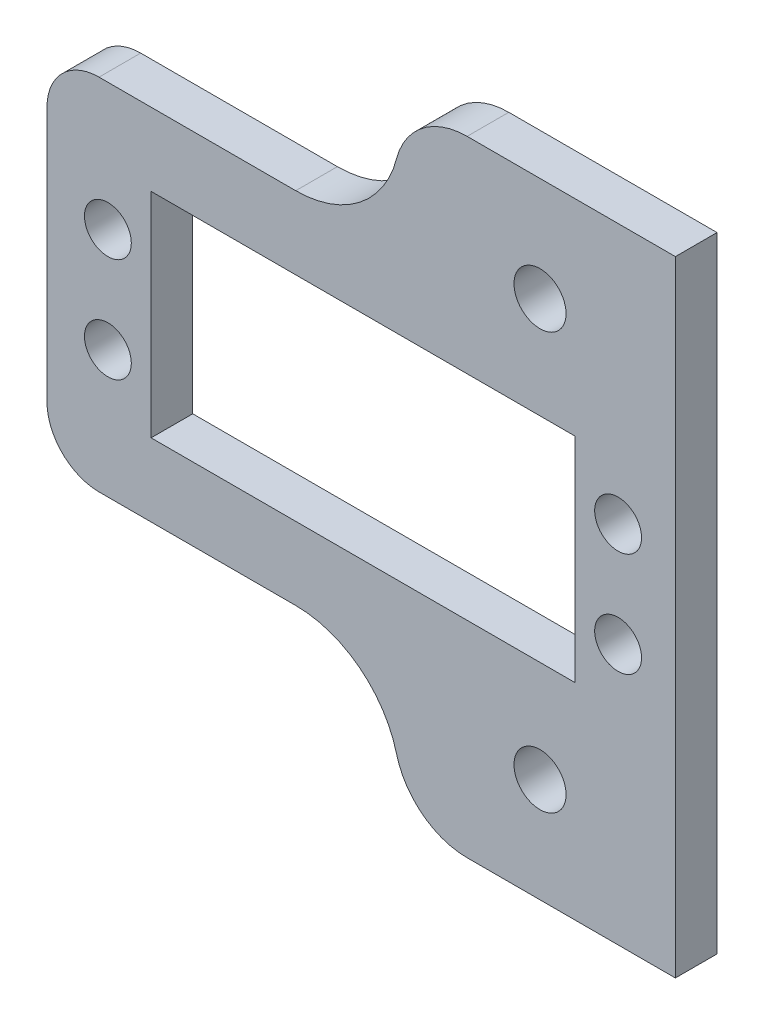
ISO-10303-21;
HEADER;
FILE_DESCRIPTION(('STEP AP214'),'2;1');
FILE_NAME('part.step','',(''),(''),'','','');
FILE_SCHEMA(('AUTOMOTIVE_DESIGN { 1 0 10303 214 1 1 1 1 }'));
ENDSEC;
DATA;
#1=APPLICATION_CONTEXT('core data for automotive mechanical design processes');
#2=APPLICATION_PROTOCOL_DEFINITION('international standard','automotive_design',2000,#1);
#3=PRODUCT_CONTEXT('',#1,'mechanical');
#4=PRODUCT('Part','Part','',(#3));
#5=PRODUCT_RELATED_PRODUCT_CATEGORY('part','',(#4));
#6=PRODUCT_DEFINITION_FORMATION('','',#4);
#7=PRODUCT_DEFINITION_CONTEXT('part definition',#1,'design');
#8=PRODUCT_DEFINITION('design','',#6,#7);
#9=PRODUCT_DEFINITION_SHAPE('','',#8);
#10=(LENGTH_UNIT() NAMED_UNIT(*) SI_UNIT(.MILLI.,.METRE.));
#11=(NAMED_UNIT(*) PLANE_ANGLE_UNIT() SI_UNIT($,.RADIAN.));
#12=(NAMED_UNIT(*) SI_UNIT($,.STERADIAN.) SOLID_ANGLE_UNIT());
#13=UNCERTAINTY_MEASURE_WITH_UNIT(LENGTH_MEASURE(1.E-05),#10,'distance_accuracy_value','');
#14=(GEOMETRIC_REPRESENTATION_CONTEXT(3) GLOBAL_UNCERTAINTY_ASSIGNED_CONTEXT((#13)) GLOBAL_UNIT_ASSIGNED_CONTEXT((#10,
#11,#12)) REPRESENTATION_CONTEXT('',''));
#15=CARTESIAN_POINT('',(0.,0.,0.));
#16=DIRECTION('',(0.,0.,1.));
#17=DIRECTION('',(1.,0.,0.));
#18=AXIS2_PLACEMENT_3D('',#15,#16,#17);
#19=CARTESIAN_POINT('',(9.99999999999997,23.,2.));
#20=DIRECTION('',(0.,0.,-1.));
#21=DIRECTION('',(-1.,0.,0.));
#22=AXIS2_PLACEMENT_3D('',#19,#20,#21);
#23=PLANE('',#22);
#24=CARTESIAN_POINT('',(-24.5,5.,2.));
#25=DIRECTION('',(0.,0.,1.));
#26=DIRECTION('',(1.,0.,0.));
#27=AXIS2_PLACEMENT_3D('',#24,#25,#26);
#28=CIRCLE('',#27,2.25);
#29=CARTESIAN_POINT('',(-22.25,5.,2.));
#30=VERTEX_POINT('',#29);
#31=EDGE_CURVE('E545',#30,#30,#28,.T.);
#32=ORIENTED_EDGE('',*,*,#31,.F.);
#33=EDGE_LOOP('',(#32));
#34=FACE_BOUND('',#33,.T.);
#35=CARTESIAN_POINT('',(-24.5,-5.,2.));
#36=DIRECTION('',(0.,0.,1.));
#37=DIRECTION('',(1.,0.,0.));
#38=AXIS2_PLACEMENT_3D('',#35,#36,#37);
#39=CIRCLE('',#38,2.25);
#40=CARTESIAN_POINT('',(-22.25,-5.,2.));
#41=VERTEX_POINT('',#40);
#42=EDGE_CURVE('E557',#41,#41,#39,.T.);
#43=ORIENTED_EDGE('',*,*,#42,.F.);
#44=EDGE_LOOP('',(#43));
#45=FACE_BOUND('',#44,.T.);
#46=CARTESIAN_POINT('',(17.,20.,2.));
#47=DIRECTION('',(0.,0.,1.));
#48=DIRECTION('',(1.,0.,0.));
#49=AXIS2_PLACEMENT_3D('',#46,#47,#48);
#50=CIRCLE('',#49,2.5);
#51=CARTESIAN_POINT('',(19.5,20.,2.));
#52=VERTEX_POINT('',#51);
#53=EDGE_CURVE('E174',#52,#52,#50,.T.);
#54=ORIENTED_EDGE('',*,*,#53,.F.);
#55=EDGE_LOOP('',(#54));
#56=FACE_BOUND('',#55,.T.);
#57=DIRECTION('',(1.,0.,0.));
#58=VECTOR('',#57,1.);
#59=CARTESIAN_POINT('',(10.,-30.,2.));
#60=LINE('',#59,#58);
#61=CARTESIAN_POINT('',(10.,-30.,2.));
#62=VERTEX_POINT('',#61);
#63=CARTESIAN_POINT('',(30.,-30.,2.));
#64=VERTEX_POINT('',#63);
#65=EDGE_CURVE('E184',#62,#64,#60,.T.);
#66=ORIENTED_EDGE('',*,*,#65,.T.);
#67=DIRECTION('',(0.,1.,0.));
#68=VECTOR('',#67,1.);
#69=CARTESIAN_POINT('',(30.,-30.,2.));
#70=LINE('',#69,#68);
#71=CARTESIAN_POINT('',(30.,30.,2.));
#72=VERTEX_POINT('',#71);
#73=EDGE_CURVE('E187',#64,#72,#70,.T.);
#74=ORIENTED_EDGE('',*,*,#73,.T.);
#75=DIRECTION('',(-1.,0.,0.));
#76=VECTOR('',#75,1.);
#77=CARTESIAN_POINT('',(9.99999999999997,30.,2.));
#78=LINE('',#77,#76);
#79=CARTESIAN_POINT('',(9.99999999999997,30.,2.));
#80=VERTEX_POINT('',#79);
#81=EDGE_CURVE('E190',#72,#80,#78,.T.);
#82=ORIENTED_EDGE('',*,*,#81,.T.);
#83=CARTESIAN_POINT('',(9.99999999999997,23.,2.));
#84=DIRECTION('',(0.,0.,1.));
#85=DIRECTION('',(-1.,0.,0.));
#86=AXIS2_PLACEMENT_3D('',#83,#84,#85);
#87=CIRCLE('',#86,6.99999999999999);
#88=CARTESIAN_POINT('',(3.22227914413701,24.75,2.));
#89=VERTEX_POINT('',#88);
#90=EDGE_CURVE('E192',#80,#89,#87,.T.);
#91=ORIENTED_EDGE('',*,*,#90,.T.);
#92=CARTESIAN_POINT('',(-6.46017922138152,27.25,2.));
#93=DIRECTION('',(0.,0.,-1.));
#94=DIRECTION('',(1.,0.,0.));
#95=AXIS2_PLACEMENT_3D('',#92,#93,#94);
#96=CIRCLE('',#95,10.);
#97=CARTESIAN_POINT('',(-6.46017922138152,17.25,2.));
#98=VERTEX_POINT('',#97);
#99=EDGE_CURVE('E194',#89,#98,#96,.T.);
#100=ORIENTED_EDGE('',*,*,#99,.T.);
#101=DIRECTION('',(-1.,0.,0.));
#102=VECTOR('',#101,1.);
#103=CARTESIAN_POINT('',(-25.35,17.25,2.));
#104=LINE('',#103,#102);
#105=CARTESIAN_POINT('',(-25.35,17.25,2.));
#106=VERTEX_POINT('',#105);
#107=EDGE_CURVE('E196',#98,#106,#104,.T.);
#108=ORIENTED_EDGE('',*,*,#107,.T.);
#109=CARTESIAN_POINT('',(-25.35,12.25,2.));
#110=DIRECTION('',(0.,0.,1.));
#111=DIRECTION('',(-1.,0.,0.));
#112=AXIS2_PLACEMENT_3D('',#109,#110,#111);
#113=CIRCLE('',#112,5.);
#114=CARTESIAN_POINT('',(-30.35,12.25,2.));
#115=VERTEX_POINT('',#114);
#116=EDGE_CURVE('E198',#106,#115,#113,.T.);
#117=ORIENTED_EDGE('',*,*,#116,.T.);
#118=DIRECTION('',(0.,-1.,0.));
#119=VECTOR('',#118,1.);
#120=CARTESIAN_POINT('',(-30.35,-12.25,2.));
#121=LINE('',#120,#119);
#122=CARTESIAN_POINT('',(-30.35,-12.25,2.));
#123=VERTEX_POINT('',#122);
#124=EDGE_CURVE('E200',#115,#123,#121,.T.);
#125=ORIENTED_EDGE('',*,*,#124,.T.);
#126=CARTESIAN_POINT('',(-25.35,-12.25,2.));
#127=DIRECTION('',(0.,0.,1.));
#128=DIRECTION('',(1.,0.,0.));
#129=AXIS2_PLACEMENT_3D('',#126,#127,#128);
#130=CIRCLE('',#129,5.);
#131=CARTESIAN_POINT('',(-25.35,-17.25,2.));
#132=VERTEX_POINT('',#131);
#133=EDGE_CURVE('E202',#123,#132,#130,.T.);
#134=ORIENTED_EDGE('',*,*,#133,.T.);
#135=DIRECTION('',(1.,0.,0.));
#136=VECTOR('',#135,1.);
#137=CARTESIAN_POINT('',(-25.35,-17.25,2.));
#138=LINE('',#137,#136);
#139=CARTESIAN_POINT('',(-6.46017922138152,-17.25,2.));
#140=VERTEX_POINT('',#139);
#141=EDGE_CURVE('E204',#132,#140,#138,.T.);
#142=ORIENTED_EDGE('',*,*,#141,.T.);
#143=CARTESIAN_POINT('',(-6.46017922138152,-27.25,2.));
#144=DIRECTION('',(0.,0.,-1.));
#145=DIRECTION('',(-1.,0.,0.));
#146=AXIS2_PLACEMENT_3D('',#143,#144,#145);
#147=CIRCLE('',#146,10.);
#148=CARTESIAN_POINT('',(3.22227914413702,-24.75,2.));
#149=VERTEX_POINT('',#148);
#150=EDGE_CURVE('E206',#140,#149,#147,.T.);
#151=ORIENTED_EDGE('',*,*,#150,.T.);
#152=CARTESIAN_POINT('',(10.,-23.,2.));
#153=DIRECTION('',(0.,0.,1.));
#154=DIRECTION('',(1.,0.,0.));
#155=AXIS2_PLACEMENT_3D('',#152,#153,#154);
#156=CIRCLE('',#155,7.);
#157=EDGE_CURVE('E208',#149,#62,#156,.T.);
#158=ORIENTED_EDGE('',*,*,#157,.T.);
#159=EDGE_LOOP('',(#66,#74,#82,#91,#100,#108,#117,#125,#134,#142,#151,#158));
#160=FACE_BOUND('',#159,.T.);
#161=DIRECTION('',(0.,-1.,0.));
#162=VECTOR('',#161,1.);
#163=CARTESIAN_POINT('',(-20.35,10.25,2.));
#164=LINE('',#163,#162);
#165=CARTESIAN_POINT('',(-20.35,10.25,2.));
#166=VERTEX_POINT('',#165);
#167=CARTESIAN_POINT('',(-20.35,-10.25,2.));
#168=VERTEX_POINT('',#167);
#169=EDGE_CURVE('E145',#166,#168,#164,.T.);
#170=ORIENTED_EDGE('',*,*,#169,.F.);
#171=DIRECTION('',(-1.,0.,0.));
#172=VECTOR('',#171,1.);
#173=CARTESIAN_POINT('',(20.35,10.25,2.));
#174=LINE('',#173,#172);
#175=CARTESIAN_POINT('',(20.35,10.25,2.));
#176=VERTEX_POINT('',#175);
#177=EDGE_CURVE('E168',#176,#166,#174,.T.);
#178=ORIENTED_EDGE('',*,*,#177,.F.);
#179=DIRECTION('',(0.,1.,0.));
#180=VECTOR('',#179,1.);
#181=CARTESIAN_POINT('',(20.35,10.25,2.));
#182=LINE('',#181,#180);
#183=CARTESIAN_POINT('',(20.35,-10.25,2.));
#184=VERTEX_POINT('',#183);
#185=EDGE_CURVE('E166',#184,#176,#182,.T.);
#186=ORIENTED_EDGE('',*,*,#185,.F.);
#187=DIRECTION('',(1.,0.,0.));
#188=VECTOR('',#187,1.);
#189=CARTESIAN_POINT('',(20.35,-10.25,2.));
#190=LINE('',#189,#188);
#191=EDGE_CURVE('E153',#168,#184,#190,.T.);
#192=ORIENTED_EDGE('',*,*,#191,.F.);
#193=EDGE_LOOP('',(#170,#178,#186,#192));
#194=FACE_BOUND('',#193,.T.);
#195=CARTESIAN_POINT('',(17.,-20.,2.));
#196=DIRECTION('',(0.,0.,1.));
#197=DIRECTION('',(1.,0.,0.));
#198=AXIS2_PLACEMENT_3D('',#195,#196,#197);
#199=CIRCLE('',#198,2.50000000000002);
#200=CARTESIAN_POINT('',(19.5,-20.,2.));
#201=VERTEX_POINT('',#200);
#202=EDGE_CURVE('E563',#201,#201,#199,.T.);
#203=ORIENTED_EDGE('',*,*,#202,.F.);
#204=EDGE_LOOP('',(#203));
#205=FACE_BOUND('',#204,.T.);
#206=CARTESIAN_POINT('',(24.5,-5.,2.));
#207=DIRECTION('',(0.,0.,1.));
#208=DIRECTION('',(1.,0.,0.));
#209=AXIS2_PLACEMENT_3D('',#206,#207,#208);
#210=CIRCLE('',#209,2.24999999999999);
#211=CARTESIAN_POINT('',(26.75,-5.,2.));
#212=VERTEX_POINT('',#211);
#213=EDGE_CURVE('E551',#212,#212,#210,.T.);
#214=ORIENTED_EDGE('',*,*,#213,.F.);
#215=EDGE_LOOP('',(#214));
#216=FACE_BOUND('',#215,.T.);
#217=CARTESIAN_POINT('',(24.5,5.,2.));
#218=DIRECTION('',(0.,0.,1.));
#219=DIRECTION('',(1.,0.,0.));
#220=AXIS2_PLACEMENT_3D('',#217,#218,#219);
#221=CIRCLE('',#220,2.25);
#222=CARTESIAN_POINT('',(26.75,5.,2.));
#223=VERTEX_POINT('',#222);
#224=EDGE_CURVE('E536',#223,#223,#221,.T.);
#225=ORIENTED_EDGE('',*,*,#224,.F.);
#226=EDGE_LOOP('',(#225));
#227=FACE_BOUND('',#226,.T.);
#228=ADVANCED_FACE('F32',(#34,#45,#56,#160,#194,#205,#216,#227),#23,.F.);
#229=CARTESIAN_POINT('',(9.99999999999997,23.,-2.));
#230=DIRECTION('',(0.,0.,-1.));
#231=DIRECTION('',(-1.,0.,0.));
#232=AXIS2_PLACEMENT_3D('',#229,#230,#231);
#233=PLANE('',#232);
#234=CARTESIAN_POINT('',(-24.5,5.,-2.));
#235=DIRECTION('',(0.,0.,1.));
#236=DIRECTION('',(1.,0.,0.));
#237=AXIS2_PLACEMENT_3D('',#234,#235,#236);
#238=CIRCLE('',#237,2.25);
#239=CARTESIAN_POINT('',(-22.25,5.,-2.));
#240=VERTEX_POINT('',#239);
#241=EDGE_CURVE('E542',#240,#240,#238,.T.);
#242=ORIENTED_EDGE('',*,*,#241,.T.);
#243=EDGE_LOOP('',(#242));
#244=FACE_BOUND('',#243,.T.);
#245=CARTESIAN_POINT('',(-24.5,-5.,-2.));
#246=DIRECTION('',(0.,0.,1.));
#247=DIRECTION('',(1.,0.,0.));
#248=AXIS2_PLACEMENT_3D('',#245,#246,#247);
#249=CIRCLE('',#248,2.25);
#250=CARTESIAN_POINT('',(-22.25,-5.,-2.));
#251=VERTEX_POINT('',#250);
#252=EDGE_CURVE('E554',#251,#251,#249,.T.);
#253=ORIENTED_EDGE('',*,*,#252,.T.);
#254=EDGE_LOOP('',(#253));
#255=FACE_BOUND('',#254,.T.);
#256=CARTESIAN_POINT('',(17.,20.,-2.));
#257=DIRECTION('',(0.,0.,1.));
#258=DIRECTION('',(1.,0.,0.));
#259=AXIS2_PLACEMENT_3D('',#256,#257,#258);
#260=CIRCLE('',#259,2.5);
#261=CARTESIAN_POINT('',(19.5,20.,-2.));
#262=VERTEX_POINT('',#261);
#263=EDGE_CURVE('E566',#262,#262,#260,.T.);
#264=ORIENTED_EDGE('',*,*,#263,.T.);
#265=EDGE_LOOP('',(#264));
#266=FACE_BOUND('',#265,.T.);
#267=DIRECTION('',(1.,0.,0.));
#268=VECTOR('',#267,1.);
#269=CARTESIAN_POINT('',(10.,-30.,-2.));
#270=LINE('',#269,#268);
#271=CARTESIAN_POINT('',(10.,-30.,-2.));
#272=VERTEX_POINT('',#271);
#273=CARTESIAN_POINT('',(30.,-30.,-2.));
#274=VERTEX_POINT('',#273);
#275=EDGE_CURVE('E161',#272,#274,#270,.T.);
#276=ORIENTED_EDGE('',*,*,#275,.F.);
#277=CARTESIAN_POINT('',(10.,-23.,-2.));
#278=DIRECTION('',(0.,0.,1.));
#279=DIRECTION('',(1.,0.,0.));
#280=AXIS2_PLACEMENT_3D('',#277,#278,#279);
#281=CIRCLE('',#280,7.);
#282=CARTESIAN_POINT('',(3.22227914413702,-24.75,-2.));
#283=VERTEX_POINT('',#282);
#284=EDGE_CURVE('E188',#283,#272,#281,.T.);
#285=ORIENTED_EDGE('',*,*,#284,.F.);
#286=CARTESIAN_POINT('',(-6.46017922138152,-27.25,-2.));
#287=DIRECTION('',(0.,0.,-1.));
#288=DIRECTION('',(-1.,0.,0.));
#289=AXIS2_PLACEMENT_3D('',#286,#287,#288);
#290=CIRCLE('',#289,10.);
#291=CARTESIAN_POINT('',(-6.46017922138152,-17.25,-2.));
#292=VERTEX_POINT('',#291);
#293=EDGE_CURVE('E231',#292,#283,#290,.T.);
#294=ORIENTED_EDGE('',*,*,#293,.F.);
#295=DIRECTION('',(1.,0.,0.));
#296=VECTOR('',#295,1.);
#297=CARTESIAN_POINT('',(-25.35,-17.25,-2.));
#298=LINE('',#297,#296);
#299=CARTESIAN_POINT('',(-25.35,-17.25,-2.));
#300=VERTEX_POINT('',#299);
#301=EDGE_CURVE('E229',#300,#292,#298,.T.);
#302=ORIENTED_EDGE('',*,*,#301,.F.);
#303=CARTESIAN_POINT('',(-25.35,-12.25,-2.));
#304=DIRECTION('',(0.,0.,1.));
#305=DIRECTION('',(1.,0.,0.));
#306=AXIS2_PLACEMENT_3D('',#303,#304,#305);
#307=CIRCLE('',#306,5.);
#308=CARTESIAN_POINT('',(-30.35,-12.25,-2.));
#309=VERTEX_POINT('',#308);
#310=EDGE_CURVE('E227',#309,#300,#307,.T.);
#311=ORIENTED_EDGE('',*,*,#310,.F.);
#312=DIRECTION('',(0.,-1.,0.));
#313=VECTOR('',#312,1.);
#314=CARTESIAN_POINT('',(-30.35,-12.25,-2.));
#315=LINE('',#314,#313);
#316=CARTESIAN_POINT('',(-30.35,12.25,-2.));
#317=VERTEX_POINT('',#316);
#318=EDGE_CURVE('E225',#317,#309,#315,.T.);
#319=ORIENTED_EDGE('',*,*,#318,.F.);
#320=CARTESIAN_POINT('',(-25.35,12.25,-2.));
#321=DIRECTION('',(0.,0.,1.));
#322=DIRECTION('',(-1.,0.,0.));
#323=AXIS2_PLACEMENT_3D('',#320,#321,#322);
#324=CIRCLE('',#323,5.);
#325=CARTESIAN_POINT('',(-25.35,17.25,-2.));
#326=VERTEX_POINT('',#325);
#327=EDGE_CURVE('E223',#326,#317,#324,.T.);
#328=ORIENTED_EDGE('',*,*,#327,.F.);
#329=DIRECTION('',(-1.,0.,0.));
#330=VECTOR('',#329,1.);
#331=CARTESIAN_POINT('',(-25.35,17.25,-2.));
#332=LINE('',#331,#330);
#333=CARTESIAN_POINT('',(-6.46017922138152,17.25,-2.));
#334=VERTEX_POINT('',#333);
#335=EDGE_CURVE('E221',#334,#326,#332,.T.);
#336=ORIENTED_EDGE('',*,*,#335,.F.);
#337=CARTESIAN_POINT('',(-6.46017922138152,27.25,-2.));
#338=DIRECTION('',(0.,0.,-1.));
#339=DIRECTION('',(1.,0.,0.));
#340=AXIS2_PLACEMENT_3D('',#337,#338,#339);
#341=CIRCLE('',#340,10.);
#342=CARTESIAN_POINT('',(3.22227914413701,24.75,-2.));
#343=VERTEX_POINT('',#342);
#344=EDGE_CURVE('E219',#343,#334,#341,.T.);
#345=ORIENTED_EDGE('',*,*,#344,.F.);
#346=CARTESIAN_POINT('',(9.99999999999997,23.,-2.));
#347=DIRECTION('',(0.,0.,1.));
#348=DIRECTION('',(-1.,0.,0.));
#349=AXIS2_PLACEMENT_3D('',#346,#347,#348);
#350=CIRCLE('',#349,6.99999999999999);
#351=CARTESIAN_POINT('',(9.99999999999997,30.,-2.));
#352=VERTEX_POINT('',#351);
#353=EDGE_CURVE('E217',#352,#343,#350,.T.);
#354=ORIENTED_EDGE('',*,*,#353,.F.);
#355=DIRECTION('',(-1.,0.,0.));
#356=VECTOR('',#355,1.);
#357=CARTESIAN_POINT('',(9.99999999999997,30.,-2.));
#358=LINE('',#357,#356);
#359=CARTESIAN_POINT('',(30.,30.,-2.));
#360=VERTEX_POINT('',#359);
#361=EDGE_CURVE('E215',#360,#352,#358,.T.);
#362=ORIENTED_EDGE('',*,*,#361,.F.);
#363=DIRECTION('',(0.,1.,0.));
#364=VECTOR('',#363,1.);
#365=CARTESIAN_POINT('',(30.,-30.,-2.));
#366=LINE('',#365,#364);
#367=EDGE_CURVE('E213',#274,#360,#366,.T.);
#368=ORIENTED_EDGE('',*,*,#367,.F.);
#369=EDGE_LOOP('',(#276,#285,#294,#302,#311,#319,#328,#336,#345,#354,#362,#368));
#370=FACE_BOUND('',#369,.T.);
#371=DIRECTION('',(-1.,0.,0.));
#372=VECTOR('',#371,1.);
#373=CARTESIAN_POINT('',(20.35,10.25,-2.));
#374=LINE('',#373,#372);
#375=CARTESIAN_POINT('',(20.35,10.25,-2.));
#376=VERTEX_POINT('',#375);
#377=CARTESIAN_POINT('',(-20.35,10.25,-2.));
#378=VERTEX_POINT('',#377);
#379=EDGE_CURVE('E154',#376,#378,#374,.T.);
#380=ORIENTED_EDGE('',*,*,#379,.T.);
#381=DIRECTION('',(0.,-1.,0.));
#382=VECTOR('',#381,1.);
#383=CARTESIAN_POINT('',(-20.35,10.25,-2.));
#384=LINE('',#383,#382);
#385=CARTESIAN_POINT('',(-20.35,-10.25,-2.));
#386=VERTEX_POINT('',#385);
#387=EDGE_CURVE('E55',#378,#386,#384,.T.);
#388=ORIENTED_EDGE('',*,*,#387,.T.);
#389=DIRECTION('',(1.,0.,0.));
#390=VECTOR('',#389,1.);
#391=CARTESIAN_POINT('',(20.35,-10.25,-2.));
#392=LINE('',#391,#390);
#393=CARTESIAN_POINT('',(20.35,-10.25,-2.));
#394=VERTEX_POINT('',#393);
#395=EDGE_CURVE('E160',#386,#394,#392,.T.);
#396=ORIENTED_EDGE('',*,*,#395,.T.);
#397=DIRECTION('',(0.,1.,0.));
#398=VECTOR('',#397,1.);
#399=CARTESIAN_POINT('',(20.35,10.25,-2.));
#400=LINE('',#399,#398);
#401=EDGE_CURVE('E176',#394,#376,#400,.T.);
#402=ORIENTED_EDGE('',*,*,#401,.T.);
#403=EDGE_LOOP('',(#380,#388,#396,#402));
#404=FACE_BOUND('',#403,.T.);
#405=CARTESIAN_POINT('',(17.,-20.,-2.));
#406=DIRECTION('',(0.,0.,1.));
#407=DIRECTION('',(1.,0.,0.));
#408=AXIS2_PLACEMENT_3D('',#405,#406,#407);
#409=CIRCLE('',#408,2.50000000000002);
#410=CARTESIAN_POINT('',(19.5,-20.,-2.));
#411=VERTEX_POINT('',#410);
#412=EDGE_CURVE('E560',#411,#411,#409,.T.);
#413=ORIENTED_EDGE('',*,*,#412,.T.);
#414=EDGE_LOOP('',(#413));
#415=FACE_BOUND('',#414,.T.);
#416=CARTESIAN_POINT('',(24.5,-5.,-2.));
#417=DIRECTION('',(0.,0.,1.));
#418=DIRECTION('',(1.,0.,0.));
#419=AXIS2_PLACEMENT_3D('',#416,#417,#418);
#420=CIRCLE('',#419,2.24999999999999);
#421=CARTESIAN_POINT('',(26.75,-5.,-2.));
#422=VERTEX_POINT('',#421);
#423=EDGE_CURVE('E548',#422,#422,#420,.T.);
#424=ORIENTED_EDGE('',*,*,#423,.T.);
#425=EDGE_LOOP('',(#424));
#426=FACE_BOUND('',#425,.T.);
#427=CARTESIAN_POINT('',(24.5,5.,-2.));
#428=DIRECTION('',(0.,0.,1.));
#429=DIRECTION('',(1.,0.,0.));
#430=AXIS2_PLACEMENT_3D('',#427,#428,#429);
#431=CIRCLE('',#430,2.25);
#432=CARTESIAN_POINT('',(26.75,5.,-2.));
#433=VERTEX_POINT('',#432);
#434=EDGE_CURVE('E539',#433,#433,#431,.T.);
#435=ORIENTED_EDGE('',*,*,#434,.T.);
#436=EDGE_LOOP('',(#435));
#437=FACE_BOUND('',#436,.T.);
#438=ADVANCED_FACE('F273',(#244,#255,#266,#370,#404,#415,#426,#437),#233,.T.);
#439=CARTESIAN_POINT('',(10.,-30.,2.));
#440=DIRECTION('',(0.,1.,0.));
#441=DIRECTION('',(0.,0.,1.));
#442=AXIS2_PLACEMENT_3D('',#439,#440,#441);
#443=PLANE('',#442);
#444=ORIENTED_EDGE('',*,*,#275,.T.);
#445=DIRECTION('',(0.,0.,-1.));
#446=VECTOR('',#445,1.);
#447=CARTESIAN_POINT('',(30.,-30.,2.));
#448=LINE('',#447,#446);
#449=EDGE_CURVE('E11',#64,#274,#448,.T.);
#450=ORIENTED_EDGE('',*,*,#449,.F.);
#451=ORIENTED_EDGE('',*,*,#65,.F.);
#452=DIRECTION('',(0.,0.,-1.));
#453=VECTOR('',#452,1.);
#454=CARTESIAN_POINT('',(10.,-30.,2.));
#455=LINE('',#454,#453);
#456=EDGE_CURVE('E210',#62,#272,#455,.T.);
#457=ORIENTED_EDGE('',*,*,#456,.T.);
#458=EDGE_LOOP('',(#444,#450,#451,#457));
#459=FACE_BOUND('',#458,.T.);
#460=ADVANCED_FACE('F34',(#459),#443,.F.);
#461=CARTESIAN_POINT('',(30.,-30.,2.));
#462=DIRECTION('',(-1.,0.,0.));
#463=DIRECTION('',(0.,0.,1.));
#464=AXIS2_PLACEMENT_3D('',#461,#462,#463);
#465=PLANE('',#464);
#466=ORIENTED_EDGE('',*,*,#367,.T.);
#467=DIRECTION('',(0.,0.,-1.));
#468=VECTOR('',#467,1.);
#469=CARTESIAN_POINT('',(30.,30.,2.));
#470=LINE('',#469,#468);
#471=EDGE_CURVE('E40',#72,#360,#470,.T.);
#472=ORIENTED_EDGE('',*,*,#471,.F.);
#473=ORIENTED_EDGE('',*,*,#73,.F.);
#474=ORIENTED_EDGE('',*,*,#449,.T.);
#475=EDGE_LOOP('',(#466,#472,#473,#474));
#476=FACE_BOUND('',#475,.T.);
#477=ADVANCED_FACE('F290',(#476),#465,.F.);
#478=CARTESIAN_POINT('',(9.99999999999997,30.,2.));
#479=DIRECTION('',(0.,-1.,0.));
#480=DIRECTION('',(0.,0.,-1.));
#481=AXIS2_PLACEMENT_3D('',#478,#479,#480);
#482=PLANE('',#481);
#483=ORIENTED_EDGE('',*,*,#361,.T.);
#484=DIRECTION('',(0.,0.,-1.));
#485=VECTOR('',#484,1.);
#486=CARTESIAN_POINT('',(9.99999999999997,30.,2.));
#487=LINE('',#486,#485);
#488=EDGE_CURVE('E260',#80,#352,#487,.T.);
#489=ORIENTED_EDGE('',*,*,#488,.F.);
#490=ORIENTED_EDGE('',*,*,#81,.F.);
#491=ORIENTED_EDGE('',*,*,#471,.T.);
#492=EDGE_LOOP('',(#483,#489,#490,#491));
#493=FACE_BOUND('',#492,.T.);
#494=ADVANCED_FACE('F267',(#493),#482,.F.);
#495=CARTESIAN_POINT('',(9.99999999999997,23.,2.));
#496=DIRECTION('',(0.,0.,-1.));
#497=DIRECTION('',(-1.,0.,0.));
#498=AXIS2_PLACEMENT_3D('',#495,#496,#497);
#499=CYLINDRICAL_SURFACE('',#498,6.99999999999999);
#500=ORIENTED_EDGE('',*,*,#353,.T.);
#501=DIRECTION('',(0.,0.,-1.));
#502=VECTOR('',#501,1.);
#503=CARTESIAN_POINT('',(3.22227914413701,24.75,2.));
#504=LINE('',#503,#502);
#505=EDGE_CURVE('E257',#89,#343,#504,.T.);
#506=ORIENTED_EDGE('',*,*,#505,.F.);
#507=ORIENTED_EDGE('',*,*,#90,.F.);
#508=ORIENTED_EDGE('',*,*,#488,.T.);
#509=EDGE_LOOP('',(#500,#506,#507,#508));
#510=FACE_BOUND('',#509,.T.);
#511=ADVANCED_FACE('F279',(#510),#499,.T.);
#512=CARTESIAN_POINT('',(-6.46017922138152,27.25,2.));
#513=DIRECTION('',(0.,0.,-1.));
#514=DIRECTION('',(-1.,0.,0.));
#515=AXIS2_PLACEMENT_3D('',#512,#513,#514);
#516=CYLINDRICAL_SURFACE('',#515,10.);
#517=ORIENTED_EDGE('',*,*,#344,.T.);
#518=DIRECTION('',(0.,0.,-1.));
#519=VECTOR('',#518,1.);
#520=CARTESIAN_POINT('',(-6.46017922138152,17.25,2.));
#521=LINE('',#520,#519);
#522=EDGE_CURVE('E254',#98,#334,#521,.T.);
#523=ORIENTED_EDGE('',*,*,#522,.F.);
#524=ORIENTED_EDGE('',*,*,#99,.F.);
#525=ORIENTED_EDGE('',*,*,#505,.T.);
#526=EDGE_LOOP('',(#517,#523,#524,#525));
#527=FACE_BOUND('',#526,.T.);
#528=ADVANCED_FACE('F283',(#527),#516,.F.);
#529=CARTESIAN_POINT('',(-25.35,17.25,2.));
#530=DIRECTION('',(0.,-1.,0.));
#531=DIRECTION('',(0.,0.,-1.));
#532=AXIS2_PLACEMENT_3D('',#529,#530,#531);
#533=PLANE('',#532);
#534=ORIENTED_EDGE('',*,*,#335,.T.);
#535=DIRECTION('',(0.,0.,-1.));
#536=VECTOR('',#535,1.);
#537=CARTESIAN_POINT('',(-25.35,17.25,2.));
#538=LINE('',#537,#536);
#539=EDGE_CURVE('E251',#106,#326,#538,.T.);
#540=ORIENTED_EDGE('',*,*,#539,.F.);
#541=ORIENTED_EDGE('',*,*,#107,.F.);
#542=ORIENTED_EDGE('',*,*,#522,.T.);
#543=EDGE_LOOP('',(#534,#540,#541,#542));
#544=FACE_BOUND('',#543,.T.);
#545=ADVANCED_FACE('F323',(#544),#533,.F.);
#546=CARTESIAN_POINT('',(-25.35,12.25,2.));
#547=DIRECTION('',(0.,0.,-1.));
#548=DIRECTION('',(-1.,0.,0.));
#549=AXIS2_PLACEMENT_3D('',#546,#547,#548);
#550=CYLINDRICAL_SURFACE('',#549,5.);
#551=ORIENTED_EDGE('',*,*,#327,.T.);
#552=DIRECTION('',(0.,0.,-1.));
#553=VECTOR('',#552,1.);
#554=CARTESIAN_POINT('',(-30.35,12.25,2.));
#555=LINE('',#554,#553);
#556=EDGE_CURVE('E248',#115,#317,#555,.T.);
#557=ORIENTED_EDGE('',*,*,#556,.F.);
#558=ORIENTED_EDGE('',*,*,#116,.F.);
#559=ORIENTED_EDGE('',*,*,#539,.T.);
#560=EDGE_LOOP('',(#551,#557,#558,#559));
#561=FACE_BOUND('',#560,.T.);
#562=ADVANCED_FACE('F321',(#561),#550,.T.);
#563=CARTESIAN_POINT('',(-30.35,-12.25,2.));
#564=DIRECTION('',(1.,0.,0.));
#565=DIRECTION('',(0.,0.,-1.));
#566=AXIS2_PLACEMENT_3D('',#563,#564,#565);
#567=PLANE('',#566);
#568=ORIENTED_EDGE('',*,*,#318,.T.);
#569=DIRECTION('',(0.,0.,-1.));
#570=VECTOR('',#569,1.);
#571=CARTESIAN_POINT('',(-30.35,-12.25,2.));
#572=LINE('',#571,#570);
#573=EDGE_CURVE('E245',#123,#309,#572,.T.);
#574=ORIENTED_EDGE('',*,*,#573,.F.);
#575=ORIENTED_EDGE('',*,*,#124,.F.);
#576=ORIENTED_EDGE('',*,*,#556,.T.);
#577=EDGE_LOOP('',(#568,#574,#575,#576));
#578=FACE_BOUND('',#577,.T.);
#579=ADVANCED_FACE('F317',(#578),#567,.F.);
#580=CARTESIAN_POINT('',(-25.35,-12.25,2.));
#581=DIRECTION('',(0.,0.,-1.));
#582=DIRECTION('',(-1.,0.,0.));
#583=AXIS2_PLACEMENT_3D('',#580,#581,#582);
#584=CYLINDRICAL_SURFACE('',#583,5.);
#585=ORIENTED_EDGE('',*,*,#310,.T.);
#586=DIRECTION('',(0.,0.,-1.));
#587=VECTOR('',#586,1.);
#588=CARTESIAN_POINT('',(-25.35,-17.25,2.));
#589=LINE('',#588,#587);
#590=EDGE_CURVE('E242',#132,#300,#589,.T.);
#591=ORIENTED_EDGE('',*,*,#590,.F.);
#592=ORIENTED_EDGE('',*,*,#133,.F.);
#593=ORIENTED_EDGE('',*,*,#573,.T.);
#594=EDGE_LOOP('',(#585,#591,#592,#593));
#595=FACE_BOUND('',#594,.T.);
#596=ADVANCED_FACE('F312',(#595),#584,.T.);
#597=CARTESIAN_POINT('',(-25.35,-17.25,2.));
#598=DIRECTION('',(0.,1.,0.));
#599=DIRECTION('',(0.,0.,1.));
#600=AXIS2_PLACEMENT_3D('',#597,#598,#599);
#601=PLANE('',#600);
#602=ORIENTED_EDGE('',*,*,#301,.T.);
#603=DIRECTION('',(0.,0.,-1.));
#604=VECTOR('',#603,1.);
#605=CARTESIAN_POINT('',(-6.46017922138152,-17.25,2.));
#606=LINE('',#605,#604);
#607=EDGE_CURVE('E239',#140,#292,#606,.T.);
#608=ORIENTED_EDGE('',*,*,#607,.F.);
#609=ORIENTED_EDGE('',*,*,#141,.F.);
#610=ORIENTED_EDGE('',*,*,#590,.T.);
#611=EDGE_LOOP('',(#602,#608,#609,#610));
#612=FACE_BOUND('',#611,.T.);
#613=ADVANCED_FACE('F306',(#612),#601,.F.);
#614=CARTESIAN_POINT('',(-6.46017922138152,-27.25,2.));
#615=DIRECTION('',(0.,0.,-1.));
#616=DIRECTION('',(-1.,0.,0.));
#617=AXIS2_PLACEMENT_3D('',#614,#615,#616);
#618=CYLINDRICAL_SURFACE('',#617,10.);
#619=ORIENTED_EDGE('',*,*,#293,.T.);
#620=DIRECTION('',(0.,0.,-1.));
#621=VECTOR('',#620,1.);
#622=CARTESIAN_POINT('',(3.22227914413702,-24.75,2.));
#623=LINE('',#622,#621);
#624=EDGE_CURVE('E236',#149,#283,#623,.T.);
#625=ORIENTED_EDGE('',*,*,#624,.F.);
#626=ORIENTED_EDGE('',*,*,#150,.F.);
#627=ORIENTED_EDGE('',*,*,#607,.T.);
#628=EDGE_LOOP('',(#619,#625,#626,#627));
#629=FACE_BOUND('',#628,.T.);
#630=ADVANCED_FACE('F302',(#629),#618,.F.);
#631=CARTESIAN_POINT('',(10.,-23.,2.));
#632=DIRECTION('',(0.,0.,-1.));
#633=DIRECTION('',(-1.,0.,0.));
#634=AXIS2_PLACEMENT_3D('',#631,#632,#633);
#635=CYLINDRICAL_SURFACE('',#634,7.);
#636=ORIENTED_EDGE('',*,*,#284,.T.);
#637=ORIENTED_EDGE('',*,*,#456,.F.);
#638=ORIENTED_EDGE('',*,*,#157,.F.);
#639=ORIENTED_EDGE('',*,*,#624,.T.);
#640=EDGE_LOOP('',(#636,#637,#638,#639));
#641=FACE_BOUND('',#640,.T.);
#642=ADVANCED_FACE('F297',(#641),#635,.T.);
#643=CARTESIAN_POINT('',(-20.35,10.25,2.));
#644=DIRECTION('',(1.,0.,0.));
#645=DIRECTION('',(0.,1.,0.));
#646=AXIS2_PLACEMENT_3D('',#643,#644,#645);
#647=PLANE('',#646);
#648=ORIENTED_EDGE('',*,*,#387,.F.);
#649=DIRECTION('',(0.,0.,-1.));
#650=VECTOR('',#649,1.);
#651=CARTESIAN_POINT('',(-20.35,10.25,2.));
#652=LINE('',#651,#650);
#653=EDGE_CURVE('E149',#166,#378,#652,.T.);
#654=ORIENTED_EDGE('',*,*,#653,.F.);
#655=ORIENTED_EDGE('',*,*,#169,.T.);
#656=DIRECTION('',(0.,0.,-1.));
#657=VECTOR('',#656,1.);
#658=CARTESIAN_POINT('',(-20.35,-10.25,2.));
#659=LINE('',#658,#657);
#660=EDGE_CURVE('E148',#168,#386,#659,.T.);
#661=ORIENTED_EDGE('',*,*,#660,.T.);
#662=EDGE_LOOP('',(#648,#654,#655,#661));
#663=FACE_BOUND('',#662,.T.);
#664=ADVANCED_FACE('F147',(#663),#647,.T.);
#665=CARTESIAN_POINT('',(20.35,-10.25,2.));
#666=DIRECTION('',(0.,1.,0.));
#667=DIRECTION('',(-1.,0.,0.));
#668=AXIS2_PLACEMENT_3D('',#665,#666,#667);
#669=PLANE('',#668);
#670=ORIENTED_EDGE('',*,*,#395,.F.);
#671=ORIENTED_EDGE('',*,*,#660,.F.);
#672=ORIENTED_EDGE('',*,*,#191,.T.);
#673=DIRECTION('',(0.,0.,-1.));
#674=VECTOR('',#673,1.);
#675=CARTESIAN_POINT('',(20.35,-10.25,2.));
#676=LINE('',#675,#674);
#677=EDGE_CURVE('E162',#184,#394,#676,.T.);
#678=ORIENTED_EDGE('',*,*,#677,.T.);
#679=EDGE_LOOP('',(#670,#671,#672,#678));
#680=FACE_BOUND('',#679,.T.);
#681=ADVANCED_FACE('F157',(#680),#669,.T.);
#682=CARTESIAN_POINT('',(20.35,10.25,2.));
#683=DIRECTION('',(-1.,0.,0.));
#684=DIRECTION('',(0.,-1.,0.));
#685=AXIS2_PLACEMENT_3D('',#682,#683,#684);
#686=PLANE('',#685);
#687=ORIENTED_EDGE('',*,*,#401,.F.);
#688=ORIENTED_EDGE('',*,*,#677,.F.);
#689=ORIENTED_EDGE('',*,*,#185,.T.);
#690=DIRECTION('',(0.,0.,-1.));
#691=VECTOR('',#690,1.);
#692=CARTESIAN_POINT('',(20.35,10.25,2.));
#693=LINE('',#692,#691);
#694=EDGE_CURVE('E47',#176,#376,#693,.T.);
#695=ORIENTED_EDGE('',*,*,#694,.T.);
#696=EDGE_LOOP('',(#687,#688,#689,#695));
#697=FACE_BOUND('',#696,.T.);
#698=ADVANCED_FACE('F385',(#697),#686,.T.);
#699=CARTESIAN_POINT('',(20.35,10.25,2.));
#700=DIRECTION('',(0.,-1.,0.));
#701=DIRECTION('',(1.,0.,0.));
#702=AXIS2_PLACEMENT_3D('',#699,#700,#701);
#703=PLANE('',#702);
#704=ORIENTED_EDGE('',*,*,#379,.F.);
#705=ORIENTED_EDGE('',*,*,#694,.F.);
#706=ORIENTED_EDGE('',*,*,#177,.T.);
#707=ORIENTED_EDGE('',*,*,#653,.T.);
#708=EDGE_LOOP('',(#704,#705,#706,#707));
#709=FACE_BOUND('',#708,.T.);
#710=ADVANCED_FACE('F391',(#709),#703,.T.);
#711=CARTESIAN_POINT('',(17.,20.,2.));
#712=DIRECTION('',(0.,0.,-1.));
#713=DIRECTION('',(-1.,0.,0.));
#714=AXIS2_PLACEMENT_3D('',#711,#712,#713);
#715=CYLINDRICAL_SURFACE('',#714,2.5);
#716=ORIENTED_EDGE('',*,*,#53,.T.);
#717=EDGE_LOOP('',(#716));
#718=FACE_BOUND('',#717,.T.);
#719=ORIENTED_EDGE('',*,*,#263,.F.);
#720=EDGE_LOOP('',(#719));
#721=FACE_BOUND('',#720,.T.);
#722=ADVANCED_FACE('F399',(#718,#721),#715,.F.);
#723=CARTESIAN_POINT('',(17.,-20.,2.));
#724=DIRECTION('',(0.,0.,-1.));
#725=DIRECTION('',(-1.,0.,0.));
#726=AXIS2_PLACEMENT_3D('',#723,#724,#725);
#727=CYLINDRICAL_SURFACE('',#726,2.50000000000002);
#728=ORIENTED_EDGE('',*,*,#202,.T.);
#729=EDGE_LOOP('',(#728));
#730=FACE_BOUND('',#729,.T.);
#731=ORIENTED_EDGE('',*,*,#412,.F.);
#732=EDGE_LOOP('',(#731));
#733=FACE_BOUND('',#732,.T.);
#734=ADVANCED_FACE('F406',(#730,#733),#727,.F.);
#735=CARTESIAN_POINT('',(-24.5,-5.,2.));
#736=DIRECTION('',(0.,0.,-1.));
#737=DIRECTION('',(-1.,0.,0.));
#738=AXIS2_PLACEMENT_3D('',#735,#736,#737);
#739=CYLINDRICAL_SURFACE('',#738,2.25);
#740=ORIENTED_EDGE('',*,*,#42,.T.);
#741=EDGE_LOOP('',(#740));
#742=FACE_BOUND('',#741,.T.);
#743=ORIENTED_EDGE('',*,*,#252,.F.);
#744=EDGE_LOOP('',(#743));
#745=FACE_BOUND('',#744,.T.);
#746=ADVANCED_FACE('F414',(#742,#745),#739,.F.);
#747=CARTESIAN_POINT('',(24.5,-5.,2.));
#748=DIRECTION('',(0.,0.,-1.));
#749=DIRECTION('',(-1.,0.,0.));
#750=AXIS2_PLACEMENT_3D('',#747,#748,#749);
#751=CYLINDRICAL_SURFACE('',#750,2.24999999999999);
#752=ORIENTED_EDGE('',*,*,#213,.T.);
#753=EDGE_LOOP('',(#752));
#754=FACE_BOUND('',#753,.T.);
#755=ORIENTED_EDGE('',*,*,#423,.F.);
#756=EDGE_LOOP('',(#755));
#757=FACE_BOUND('',#756,.T.);
#758=ADVANCED_FACE('F422',(#754,#757),#751,.F.);
#759=CARTESIAN_POINT('',(-24.5,5.,2.));
#760=DIRECTION('',(0.,0.,-1.));
#761=DIRECTION('',(-1.,0.,0.));
#762=AXIS2_PLACEMENT_3D('',#759,#760,#761);
#763=CYLINDRICAL_SURFACE('',#762,2.25);
#764=ORIENTED_EDGE('',*,*,#31,.T.);
#765=EDGE_LOOP('',(#764));
#766=FACE_BOUND('',#765,.T.);
#767=ORIENTED_EDGE('',*,*,#241,.F.);
#768=EDGE_LOOP('',(#767));
#769=FACE_BOUND('',#768,.T.);
#770=ADVANCED_FACE('F430',(#766,#769),#763,.F.);
#771=CARTESIAN_POINT('',(24.5,5.,2.));
#772=DIRECTION('',(0.,0.,-1.));
#773=DIRECTION('',(-1.,0.,0.));
#774=AXIS2_PLACEMENT_3D('',#771,#772,#773);
#775=CYLINDRICAL_SURFACE('',#774,2.25);
#776=ORIENTED_EDGE('',*,*,#224,.T.);
#777=EDGE_LOOP('',(#776));
#778=FACE_BOUND('',#777,.T.);
#779=ORIENTED_EDGE('',*,*,#434,.F.);
#780=EDGE_LOOP('',(#779));
#781=FACE_BOUND('',#780,.T.);
#782=ADVANCED_FACE('F438',(#778,#781),#775,.F.);
#783=CLOSED_SHELL('',(#228,#438,#460,#477,#494,#511,#528,#545,#562,#579,#596,#613,#630,#642,
#664,#681,#698,#710,#722,#734,#746,#758,#770,#782));
#784=MANIFOLD_SOLID_BREP('B2',#783);
#785=ADVANCED_BREP_SHAPE_REPRESENTATION('',(#18,#784),#14);
#786=SHAPE_DEFINITION_REPRESENTATION(#9,#785);
ENDSEC;
END-ISO-10303-21;
